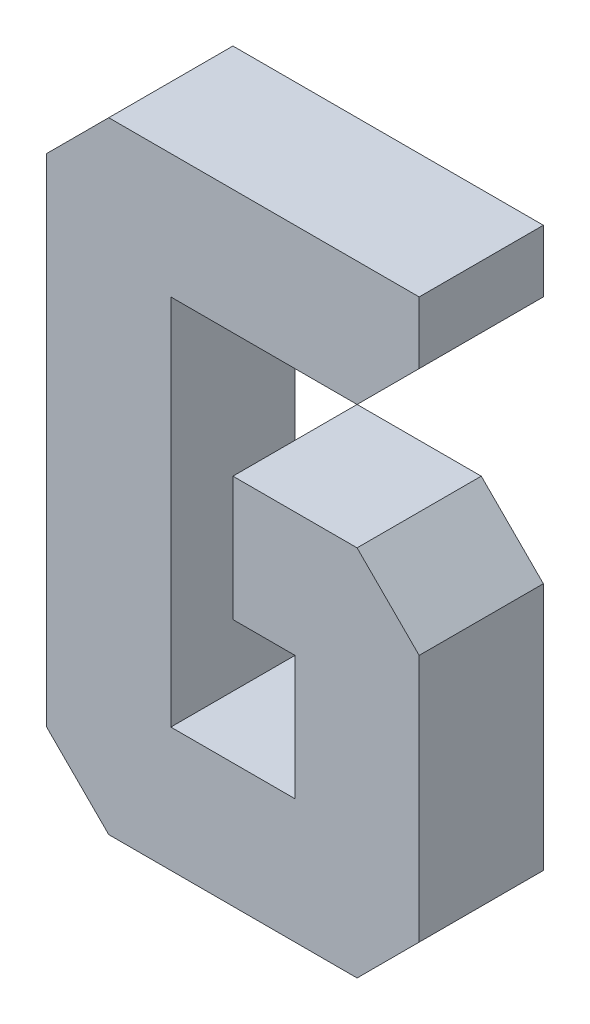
ISO-10303-21;
HEADER;
FILE_DESCRIPTION(('STEP AP214'),'2;1');
FILE_NAME('part.step','',(''),(''),'','','');
FILE_SCHEMA(('AUTOMOTIVE_DESIGN { 1 0 10303 214 1 1 1 1 }'));
ENDSEC;
DATA;
#1=APPLICATION_CONTEXT('core data for automotive mechanical design processes');
#2=APPLICATION_PROTOCOL_DEFINITION('international standard','automotive_design',2000,#1);
#3=PRODUCT_CONTEXT('',#1,'mechanical');
#4=PRODUCT('Part','Part','',(#3));
#5=PRODUCT_RELATED_PRODUCT_CATEGORY('part','',(#4));
#6=PRODUCT_DEFINITION_FORMATION('','',#4);
#7=PRODUCT_DEFINITION_CONTEXT('part definition',#1,'design');
#8=PRODUCT_DEFINITION('design','',#6,#7);
#9=PRODUCT_DEFINITION_SHAPE('','',#8);
#10=(LENGTH_UNIT() NAMED_UNIT(*) SI_UNIT(.MILLI.,.METRE.));
#11=(NAMED_UNIT(*) PLANE_ANGLE_UNIT() SI_UNIT($,.RADIAN.));
#12=(NAMED_UNIT(*) SI_UNIT($,.STERADIAN.) SOLID_ANGLE_UNIT());
#13=UNCERTAINTY_MEASURE_WITH_UNIT(LENGTH_MEASURE(1.E-05),#10,'distance_accuracy_value','');
#14=(GEOMETRIC_REPRESENTATION_CONTEXT(3) GLOBAL_UNCERTAINTY_ASSIGNED_CONTEXT((#13)) GLOBAL_UNIT_ASSIGNED_CONTEXT((#10,
#11,#12)) REPRESENTATION_CONTEXT('',''));
#15=CARTESIAN_POINT('',(0.,0.,0.));
#16=DIRECTION('',(0.,0.,1.));
#17=DIRECTION('',(1.,0.,0.));
#18=AXIS2_PLACEMENT_3D('',#15,#16,#17);
#19=CARTESIAN_POINT('',(0.,30.,10.));
#20=DIRECTION('',(0.,-1.,0.));
#21=DIRECTION('',(1.,0.,0.));
#22=AXIS2_PLACEMENT_3D('',#19,#20,#21);
#23=PLANE('',#22);
#24=DIRECTION('',(-1.,0.,0.));
#25=VECTOR('',#24,1.);
#26=CARTESIAN_POINT('',(0.,30.,10.));
#27=LINE('',#26,#25);
#28=CARTESIAN_POINT('',(25.,30.,10.));
#29=VERTEX_POINT('',#28);
#30=CARTESIAN_POINT('',(15.,30.,10.));
#31=VERTEX_POINT('',#30);
#32=EDGE_CURVE('E151',#29,#31,#27,.T.);
#33=ORIENTED_EDGE('',*,*,#32,.F.);
#34=DIRECTION('',(0.,0.,-1.));
#35=VECTOR('',#34,1.);
#36=CARTESIAN_POINT('',(25.,30.,10.));
#37=LINE('',#36,#35);
#38=CARTESIAN_POINT('',(25.,30.,0.));
#39=VERTEX_POINT('',#38);
#40=EDGE_CURVE('E177',#29,#39,#37,.T.);
#41=ORIENTED_EDGE('',*,*,#40,.T.);
#42=DIRECTION('',(-1.,0.,0.));
#43=VECTOR('',#42,1.);
#44=CARTESIAN_POINT('',(0.,30.,0.));
#45=LINE('',#44,#43);
#46=CARTESIAN_POINT('',(15.,30.,0.));
#47=VERTEX_POINT('',#46);
#48=EDGE_CURVE('E175',#39,#47,#45,.T.);
#49=ORIENTED_EDGE('',*,*,#48,.T.);
#50=DIRECTION('',(0.,0.,-1.));
#51=VECTOR('',#50,1.);
#52=CARTESIAN_POINT('',(15.,30.,10.));
#53=LINE('',#52,#51);
#54=EDGE_CURVE('E169',#31,#47,#53,.T.);
#55=ORIENTED_EDGE('',*,*,#54,.F.);
#56=EDGE_LOOP('',(#33,#41,#49,#55));
#57=FACE_BOUND('',#56,.T.);
#58=ADVANCED_FACE('F35',(#57),#23,.F.);
#59=CARTESIAN_POINT('',(15.,0.,10.));
#60=DIRECTION('',(1.,0.,0.));
#61=DIRECTION('',(0.,1.,0.));
#62=AXIS2_PLACEMENT_3D('',#59,#60,#61);
#63=PLANE('',#62);
#64=DIRECTION('',(0.,-1.,0.));
#65=VECTOR('',#64,1.);
#66=CARTESIAN_POINT('',(15.,0.,0.));
#67=LINE('',#66,#65);
#68=CARTESIAN_POINT('',(15.,20.,0.));
#69=VERTEX_POINT('',#68);
#70=EDGE_CURVE('E266',#47,#69,#67,.T.);
#71=ORIENTED_EDGE('',*,*,#70,.T.);
#72=DIRECTION('',(0.,0.,-1.));
#73=VECTOR('',#72,1.);
#74=CARTESIAN_POINT('',(15.,20.,10.));
#75=LINE('',#74,#73);
#76=CARTESIAN_POINT('',(15.,20.,10.));
#77=VERTEX_POINT('',#76);
#78=EDGE_CURVE('E170',#77,#69,#75,.T.);
#79=ORIENTED_EDGE('',*,*,#78,.F.);
#80=DIRECTION('',(0.,-1.,0.));
#81=VECTOR('',#80,1.);
#82=CARTESIAN_POINT('',(15.,0.,10.));
#83=LINE('',#82,#81);
#84=EDGE_CURVE('E155',#31,#77,#83,.T.);
#85=ORIENTED_EDGE('',*,*,#84,.F.);
#86=ORIENTED_EDGE('',*,*,#54,.T.);
#87=EDGE_LOOP('',(#71,#79,#85,#86));
#88=FACE_BOUND('',#87,.T.);
#89=ADVANCED_FACE('F168',(#88),#63,.F.);
#90=CARTESIAN_POINT('',(0.,20.,10.));
#91=DIRECTION('',(0.,-1.,0.));
#92=DIRECTION('',(0.,0.,-1.));
#93=AXIS2_PLACEMENT_3D('',#90,#91,#92);
#94=PLANE('',#93);
#95=DIRECTION('',(-1.,0.,0.));
#96=VECTOR('',#95,1.);
#97=CARTESIAN_POINT('',(0.,20.,0.));
#98=LINE('',#97,#96);
#99=CARTESIAN_POINT('',(20.,20.,0.));
#100=VERTEX_POINT('',#99);
#101=EDGE_CURVE('E264',#100,#69,#98,.T.);
#102=ORIENTED_EDGE('',*,*,#101,.F.);
#103=DIRECTION('',(0.,0.,-1.));
#104=VECTOR('',#103,1.);
#105=CARTESIAN_POINT('',(20.,20.,10.));
#106=LINE('',#105,#104);
#107=CARTESIAN_POINT('',(20.,20.,10.));
#108=VERTEX_POINT('',#107);
#109=EDGE_CURVE('E181',#108,#100,#106,.T.);
#110=ORIENTED_EDGE('',*,*,#109,.F.);
#111=DIRECTION('',(-1.,0.,0.));
#112=VECTOR('',#111,1.);
#113=CARTESIAN_POINT('',(0.,20.,10.));
#114=LINE('',#113,#112);
#115=EDGE_CURVE('E172',#108,#77,#114,.T.);
#116=ORIENTED_EDGE('',*,*,#115,.T.);
#117=ORIENTED_EDGE('',*,*,#78,.T.);
#118=EDGE_LOOP('',(#102,#110,#116,#117));
#119=FACE_BOUND('',#118,.T.);
#120=ADVANCED_FACE('F265',(#119),#94,.T.);
#121=CARTESIAN_POINT('',(20.,0.,10.));
#122=DIRECTION('',(-1.,0.,0.));
#123=DIRECTION('',(0.,0.,1.));
#124=AXIS2_PLACEMENT_3D('',#121,#122,#123);
#125=PLANE('',#124);
#126=DIRECTION('',(0.,1.,0.));
#127=VECTOR('',#126,1.);
#128=CARTESIAN_POINT('',(20.,0.,0.));
#129=LINE('',#128,#127);
#130=CARTESIAN_POINT('',(20.,10.,0.));
#131=VERTEX_POINT('',#130);
#132=EDGE_CURVE('E258',#131,#100,#129,.T.);
#133=ORIENTED_EDGE('',*,*,#132,.F.);
#134=DIRECTION('',(0.,0.,-1.));
#135=VECTOR('',#134,1.);
#136=CARTESIAN_POINT('',(20.,10.,10.));
#137=LINE('',#136,#135);
#138=CARTESIAN_POINT('',(20.,10.,10.));
#139=VERTEX_POINT('',#138);
#140=EDGE_CURVE('E251',#139,#131,#137,.T.);
#141=ORIENTED_EDGE('',*,*,#140,.F.);
#142=DIRECTION('',(0.,1.,0.));
#143=VECTOR('',#142,1.);
#144=CARTESIAN_POINT('',(20.,0.,10.));
#145=LINE('',#144,#143);
#146=EDGE_CURVE('E261',#139,#108,#145,.T.);
#147=ORIENTED_EDGE('',*,*,#146,.T.);
#148=ORIENTED_EDGE('',*,*,#109,.T.);
#149=EDGE_LOOP('',(#133,#141,#147,#148));
#150=FACE_BOUND('',#149,.T.);
#151=ADVANCED_FACE('F256',(#150),#125,.T.);
#152=CARTESIAN_POINT('',(0.,10.,10.));
#153=DIRECTION('',(0.,1.,0.));
#154=DIRECTION('',(-1.,0.,0.));
#155=AXIS2_PLACEMENT_3D('',#152,#153,#154);
#156=PLANE('',#155);
#157=DIRECTION('',(1.,0.,0.));
#158=VECTOR('',#157,1.);
#159=CARTESIAN_POINT('',(0.,10.,0.));
#160=LINE('',#159,#158);
#161=CARTESIAN_POINT('',(10.,10.,0.));
#162=VERTEX_POINT('',#161);
#163=EDGE_CURVE('E270',#162,#131,#160,.T.);
#164=ORIENTED_EDGE('',*,*,#163,.F.);
#165=DIRECTION('',(0.,0.,-1.));
#166=VECTOR('',#165,1.);
#167=CARTESIAN_POINT('',(10.,10.,10.));
#168=LINE('',#167,#166);
#169=CARTESIAN_POINT('',(10.,10.,10.));
#170=VERTEX_POINT('',#169);
#171=EDGE_CURVE('E249',#170,#162,#168,.T.);
#172=ORIENTED_EDGE('',*,*,#171,.F.);
#173=DIRECTION('',(1.,0.,0.));
#174=VECTOR('',#173,1.);
#175=CARTESIAN_POINT('',(0.,10.,10.));
#176=LINE('',#175,#174);
#177=EDGE_CURVE('E316',#170,#139,#176,.T.);
#178=ORIENTED_EDGE('',*,*,#177,.T.);
#179=ORIENTED_EDGE('',*,*,#140,.T.);
#180=EDGE_LOOP('',(#164,#172,#178,#179));
#181=FACE_BOUND('',#180,.T.);
#182=ADVANCED_FACE('F314',(#181),#156,.T.);
#183=CARTESIAN_POINT('',(10.,0.,10.));
#184=DIRECTION('',(-1.,0.,0.));
#185=DIRECTION('',(0.,-1.,0.));
#186=AXIS2_PLACEMENT_3D('',#183,#184,#185);
#187=PLANE('',#186);
#188=DIRECTION('',(0.,1.,0.));
#189=VECTOR('',#188,1.);
#190=CARTESIAN_POINT('',(10.,0.,0.));
#191=LINE('',#190,#189);
#192=CARTESIAN_POINT('',(10.,40.,0.));
#193=VERTEX_POINT('',#192);
#194=EDGE_CURVE('E272',#162,#193,#191,.T.);
#195=ORIENTED_EDGE('',*,*,#194,.T.);
#196=DIRECTION('',(0.,0.,-1.));
#197=VECTOR('',#196,1.);
#198=CARTESIAN_POINT('',(10.,40.,10.));
#199=LINE('',#198,#197);
#200=CARTESIAN_POINT('',(10.,40.,10.));
#201=VERTEX_POINT('',#200);
#202=EDGE_CURVE('E245',#201,#193,#199,.T.);
#203=ORIENTED_EDGE('',*,*,#202,.F.);
#204=DIRECTION('',(0.,1.,0.));
#205=VECTOR('',#204,1.);
#206=CARTESIAN_POINT('',(10.,0.,10.));
#207=LINE('',#206,#205);
#208=EDGE_CURVE('E311',#170,#201,#207,.T.);
#209=ORIENTED_EDGE('',*,*,#208,.F.);
#210=ORIENTED_EDGE('',*,*,#171,.T.);
#211=EDGE_LOOP('',(#195,#203,#209,#210));
#212=FACE_BOUND('',#211,.T.);
#213=ADVANCED_FACE('F310',(#212),#187,.F.);
#214=CARTESIAN_POINT('',(0.,40.,10.));
#215=DIRECTION('',(0.,1.,0.));
#216=DIRECTION('',(0.,0.,1.));
#217=AXIS2_PLACEMENT_3D('',#214,#215,#216);
#218=PLANE('',#217);
#219=DIRECTION('',(1.,0.,0.));
#220=VECTOR('',#219,1.);
#221=CARTESIAN_POINT('',(0.,40.,0.));
#222=LINE('',#221,#220);
#223=CARTESIAN_POINT('',(25.,40.,0.));
#224=VERTEX_POINT('',#223);
#225=EDGE_CURVE('E277',#193,#224,#222,.T.);
#226=ORIENTED_EDGE('',*,*,#225,.T.);
#227=DIRECTION('',(0.,0.,1.));
#228=VECTOR('',#227,1.);
#229=CARTESIAN_POINT('',(25.,40.,10.));
#230=LINE('',#229,#228);
#231=CARTESIAN_POINT('',(25.,40.,10.));
#232=VERTEX_POINT('',#231);
#233=EDGE_CURVE('E217',#224,#232,#230,.T.);
#234=ORIENTED_EDGE('',*,*,#233,.T.);
#235=DIRECTION('',(1.,0.,0.));
#236=VECTOR('',#235,1.);
#237=CARTESIAN_POINT('',(0.,40.,10.));
#238=LINE('',#237,#236);
#239=EDGE_CURVE('E307',#201,#232,#238,.T.);
#240=ORIENTED_EDGE('',*,*,#239,.F.);
#241=ORIENTED_EDGE('',*,*,#202,.T.);
#242=EDGE_LOOP('',(#226,#234,#240,#241));
#243=FACE_BOUND('',#242,.T.);
#244=ADVANCED_FACE('F303',(#243),#218,.F.);
#245=CARTESIAN_POINT('',(30.,0.,10.));
#246=DIRECTION('',(1.,0.,0.));
#247=DIRECTION('',(0.,1.,0.));
#248=AXIS2_PLACEMENT_3D('',#245,#246,#247);
#249=PLANE('',#248);
#250=DIRECTION('',(0.,-1.,0.));
#251=VECTOR('',#250,1.);
#252=CARTESIAN_POINT('',(30.,0.,10.));
#253=LINE('',#252,#251);
#254=CARTESIAN_POINT('',(30.,50.,10.));
#255=VERTEX_POINT('',#254);
#256=CARTESIAN_POINT('',(30.,45.,10.));
#257=VERTEX_POINT('',#256);
#258=EDGE_CURVE('E296',#255,#257,#253,.T.);
#259=ORIENTED_EDGE('',*,*,#258,.T.);
#260=DIRECTION('',(0.,0.,-1.));
#261=VECTOR('',#260,1.);
#262=CARTESIAN_POINT('',(30.,45.,0.));
#263=LINE('',#262,#261);
#264=CARTESIAN_POINT('',(30.,45.,0.));
#265=VERTEX_POINT('',#264);
#266=EDGE_CURVE('E212',#257,#265,#263,.T.);
#267=ORIENTED_EDGE('',*,*,#266,.T.);
#268=DIRECTION('',(0.,-1.,0.));
#269=VECTOR('',#268,1.);
#270=CARTESIAN_POINT('',(30.,0.,0.));
#271=LINE('',#270,#269);
#272=CARTESIAN_POINT('',(30.,50.,0.));
#273=VERTEX_POINT('',#272);
#274=EDGE_CURVE('E280',#273,#265,#271,.T.);
#275=ORIENTED_EDGE('',*,*,#274,.F.);
#276=DIRECTION('',(0.,0.,-1.));
#277=VECTOR('',#276,1.);
#278=CARTESIAN_POINT('',(30.,50.,10.));
#279=LINE('',#278,#277);
#280=EDGE_CURVE('E242',#255,#273,#279,.T.);
#281=ORIENTED_EDGE('',*,*,#280,.F.);
#282=EDGE_LOOP('',(#259,#267,#275,#281));
#283=FACE_BOUND('',#282,.T.);
#284=ADVANCED_FACE('F294',(#283),#249,.T.);
#285=CARTESIAN_POINT('',(0.,50.,10.));
#286=DIRECTION('',(0.,1.,0.));
#287=DIRECTION('',(0.,0.,1.));
#288=AXIS2_PLACEMENT_3D('',#285,#286,#287);
#289=PLANE('',#288);
#290=DIRECTION('',(1.,0.,0.));
#291=VECTOR('',#290,1.);
#292=CARTESIAN_POINT('',(0.,50.,0.));
#293=LINE('',#292,#291);
#294=CARTESIAN_POINT('',(5.00000000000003,50.,0.));
#295=VERTEX_POINT('',#294);
#296=EDGE_CURVE('E238',#295,#273,#293,.T.);
#297=ORIENTED_EDGE('',*,*,#296,.F.);
#298=DIRECTION('',(0.,0.,1.));
#299=VECTOR('',#298,1.);
#300=CARTESIAN_POINT('',(5.00000000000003,50.,10.));
#301=LINE('',#300,#299);
#302=CARTESIAN_POINT('',(5.00000000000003,50.,10.));
#303=VERTEX_POINT('',#302);
#304=EDGE_CURVE('E207',#295,#303,#301,.T.);
#305=ORIENTED_EDGE('',*,*,#304,.T.);
#306=DIRECTION('',(1.,0.,0.));
#307=VECTOR('',#306,1.);
#308=CARTESIAN_POINT('',(0.,50.,10.));
#309=LINE('',#308,#307);
#310=EDGE_CURVE('E290',#303,#255,#309,.T.);
#311=ORIENTED_EDGE('',*,*,#310,.T.);
#312=ORIENTED_EDGE('',*,*,#280,.T.);
#313=EDGE_LOOP('',(#297,#305,#311,#312));
#314=FACE_BOUND('',#313,.T.);
#315=ADVANCED_FACE('F288',(#314),#289,.T.);
#316=CARTESIAN_POINT('',(0.,0.,10.));
#317=DIRECTION('',(-1.,0.,0.));
#318=DIRECTION('',(0.,-1.,0.));
#319=AXIS2_PLACEMENT_3D('',#316,#317,#318);
#320=PLANE('',#319);
#321=DIRECTION('',(0.,1.,0.));
#322=VECTOR('',#321,1.);
#323=CARTESIAN_POINT('',(0.,0.,0.));
#324=LINE('',#323,#322);
#325=CARTESIAN_POINT('',(0.,5.00000000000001,0.));
#326=VERTEX_POINT('',#325);
#327=CARTESIAN_POINT('',(0.,45.,0.));
#328=VERTEX_POINT('',#327);
#329=EDGE_CURVE('E235',#326,#328,#324,.T.);
#330=ORIENTED_EDGE('',*,*,#329,.F.);
#331=DIRECTION('',(0.,0.,1.));
#332=VECTOR('',#331,1.);
#333=CARTESIAN_POINT('',(0.,5.00000000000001,10.));
#334=LINE('',#333,#332);
#335=CARTESIAN_POINT('',(0.,5.00000000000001,10.));
#336=VERTEX_POINT('',#335);
#337=EDGE_CURVE('E43',#326,#336,#334,.T.);
#338=ORIENTED_EDGE('',*,*,#337,.T.);
#339=DIRECTION('',(0.,1.,0.));
#340=VECTOR('',#339,1.);
#341=CARTESIAN_POINT('',(0.,0.,10.));
#342=LINE('',#341,#340);
#343=CARTESIAN_POINT('',(0.,45.,10.));
#344=VERTEX_POINT('',#343);
#345=EDGE_CURVE('E325',#336,#344,#342,.T.);
#346=ORIENTED_EDGE('',*,*,#345,.T.);
#347=DIRECTION('',(0.,0.,-1.));
#348=VECTOR('',#347,1.);
#349=CARTESIAN_POINT('',(0.,45.,10.));
#350=LINE('',#349,#348);
#351=EDGE_CURVE('E202',#344,#328,#350,.T.);
#352=ORIENTED_EDGE('',*,*,#351,.T.);
#353=EDGE_LOOP('',(#330,#338,#346,#352));
#354=FACE_BOUND('',#353,.T.);
#355=ADVANCED_FACE('F362',(#354),#320,.T.);
#356=CARTESIAN_POINT('',(0.,0.,10.));
#357=DIRECTION('',(0.,1.,0.));
#358=DIRECTION('',(0.,0.,1.));
#359=AXIS2_PLACEMENT_3D('',#356,#357,#358);
#360=PLANE('',#359);
#361=DIRECTION('',(1.,0.,0.));
#362=VECTOR('',#361,1.);
#363=CARTESIAN_POINT('',(0.,0.,10.));
#364=LINE('',#363,#362);
#365=CARTESIAN_POINT('',(4.99999999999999,0.,10.));
#366=VERTEX_POINT('',#365);
#367=CARTESIAN_POINT('',(25.,0.,10.));
#368=VERTEX_POINT('',#367);
#369=EDGE_CURVE('E229',#366,#368,#364,.T.);
#370=ORIENTED_EDGE('',*,*,#369,.F.);
#371=DIRECTION('',(0.,0.,-1.));
#372=VECTOR('',#371,1.);
#373=CARTESIAN_POINT('',(4.99999999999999,0.,0.));
#374=LINE('',#373,#372);
#375=CARTESIAN_POINT('',(4.99999999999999,0.,0.));
#376=VERTEX_POINT('',#375);
#377=EDGE_CURVE('E221',#366,#376,#374,.T.);
#378=ORIENTED_EDGE('',*,*,#377,.T.);
#379=DIRECTION('',(1.,0.,0.));
#380=VECTOR('',#379,1.);
#381=CARTESIAN_POINT('',(0.,0.,0.));
#382=LINE('',#381,#380);
#383=CARTESIAN_POINT('',(25.,0.,0.));
#384=VERTEX_POINT('',#383);
#385=EDGE_CURVE('E228',#376,#384,#382,.T.);
#386=ORIENTED_EDGE('',*,*,#385,.T.);
#387=DIRECTION('',(0.,0.,1.));
#388=VECTOR('',#387,1.);
#389=CARTESIAN_POINT('',(25.,0.,10.));
#390=LINE('',#389,#388);
#391=EDGE_CURVE('E197',#384,#368,#390,.T.);
#392=ORIENTED_EDGE('',*,*,#391,.T.);
#393=EDGE_LOOP('',(#370,#378,#386,#392));
#394=FACE_BOUND('',#393,.T.);
#395=ADVANCED_FACE('F227',(#394),#360,.F.);
#396=CARTESIAN_POINT('',(30.,0.,10.));
#397=DIRECTION('',(-1.,0.,0.));
#398=DIRECTION('',(0.,0.,1.));
#399=AXIS2_PLACEMENT_3D('',#396,#397,#398);
#400=PLANE('',#399);
#401=DIRECTION('',(0.,1.,0.));
#402=VECTOR('',#401,1.);
#403=CARTESIAN_POINT('',(30.,0.,10.));
#404=LINE('',#403,#402);
#405=CARTESIAN_POINT('',(30.,5.,10.));
#406=VERTEX_POINT('',#405);
#407=CARTESIAN_POINT('',(30.,25.,10.));
#408=VERTEX_POINT('',#407);
#409=EDGE_CURVE('E246',#406,#408,#404,.T.);
#410=ORIENTED_EDGE('',*,*,#409,.F.);
#411=DIRECTION('',(0.,0.,-1.));
#412=VECTOR('',#411,1.);
#413=CARTESIAN_POINT('',(30.,5.,10.));
#414=LINE('',#413,#412);
#415=CARTESIAN_POINT('',(30.,5.,0.));
#416=VERTEX_POINT('',#415);
#417=EDGE_CURVE('E191',#406,#416,#414,.T.);
#418=ORIENTED_EDGE('',*,*,#417,.T.);
#419=DIRECTION('',(0.,1.,0.));
#420=VECTOR('',#419,1.);
#421=CARTESIAN_POINT('',(30.,0.,0.));
#422=LINE('',#421,#420);
#423=CARTESIAN_POINT('',(30.,25.,0.));
#424=VERTEX_POINT('',#423);
#425=EDGE_CURVE('E163',#416,#424,#422,.T.);
#426=ORIENTED_EDGE('',*,*,#425,.T.);
#427=DIRECTION('',(0.,0.,1.));
#428=VECTOR('',#427,1.);
#429=CARTESIAN_POINT('',(30.,25.,10.));
#430=LINE('',#429,#428);
#431=EDGE_CURVE('E187',#424,#408,#430,.T.);
#432=ORIENTED_EDGE('',*,*,#431,.T.);
#433=EDGE_LOOP('',(#410,#418,#426,#432));
#434=FACE_BOUND('',#433,.T.);
#435=ADVANCED_FACE('F334',(#434),#400,.F.);
#436=CARTESIAN_POINT('',(0.,0.,10.));
#437=DIRECTION('',(0.,0.,1.));
#438=DIRECTION('',(1.,0.,0.));
#439=AXIS2_PLACEMENT_3D('',#436,#437,#438);
#440=PLANE('',#439);
#441=ORIENTED_EDGE('',*,*,#345,.F.);
#442=DIRECTION('',(0.707106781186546,-0.707106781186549,0.));
#443=VECTOR('',#442,1.);
#444=CARTESIAN_POINT('',(2.50000000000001,2.5,10.));
#445=LINE('',#444,#443);
#446=EDGE_CURVE('E11',#336,#366,#445,.T.);
#447=ORIENTED_EDGE('',*,*,#446,.T.);
#448=ORIENTED_EDGE('',*,*,#369,.T.);
#449=DIRECTION('',(-0.707106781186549,-0.707106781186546,0.));
#450=VECTOR('',#449,1.);
#451=CARTESIAN_POINT('',(12.4999999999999,-12.5,10.));
#452=LINE('',#451,#450);
#453=EDGE_CURVE('E200',#368,#406,#452,.F.);
#454=ORIENTED_EDGE('',*,*,#453,.T.);
#455=ORIENTED_EDGE('',*,*,#409,.T.);
#456=DIRECTION('',(0.707106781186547,-0.707106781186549,0.));
#457=VECTOR('',#456,1.);
#458=CARTESIAN_POINT('',(27.5,27.5,10.));
#459=LINE('',#458,#457);
#460=EDGE_CURVE('E158',#408,#29,#459,.F.);
#461=ORIENTED_EDGE('',*,*,#460,.T.);
#462=ORIENTED_EDGE('',*,*,#32,.T.);
#463=ORIENTED_EDGE('',*,*,#84,.T.);
#464=ORIENTED_EDGE('',*,*,#115,.F.);
#465=ORIENTED_EDGE('',*,*,#146,.F.);
#466=ORIENTED_EDGE('',*,*,#177,.F.);
#467=ORIENTED_EDGE('',*,*,#208,.T.);
#468=ORIENTED_EDGE('',*,*,#239,.T.);
#469=DIRECTION('',(0.70710678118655,0.707106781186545,0.));
#470=VECTOR('',#469,1.);
#471=CARTESIAN_POINT('',(-7.50000000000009,7.50000000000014,10.));
#472=LINE('',#471,#470);
#473=EDGE_CURVE('E219',#232,#257,#472,.T.);
#474=ORIENTED_EDGE('',*,*,#473,.T.);
#475=ORIENTED_EDGE('',*,*,#258,.F.);
#476=ORIENTED_EDGE('',*,*,#310,.F.);
#477=DIRECTION('',(0.707106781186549,0.707106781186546,0.));
#478=VECTOR('',#477,1.);
#479=CARTESIAN_POINT('',(-22.5,22.5000000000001,10.));
#480=LINE('',#479,#478);
#481=EDGE_CURVE('E209',#303,#344,#480,.F.);
#482=ORIENTED_EDGE('',*,*,#481,.T.);
#483=EDGE_LOOP('',(#441,#447,#448,#454,#455,#461,#462,#463,#464,#465,#466,#467,#468,#474,#475,
#476,#482));
#484=FACE_BOUND('',#483,.T.);
#485=ADVANCED_FACE('F153',(#484),#440,.T.);
#486=CARTESIAN_POINT('',(0.,0.,0.));
#487=DIRECTION('',(0.,0.,1.));
#488=DIRECTION('',(1.,0.,0.));
#489=AXIS2_PLACEMENT_3D('',#486,#487,#488);
#490=PLANE('',#489);
#491=ORIENTED_EDGE('',*,*,#385,.F.);
#492=DIRECTION('',(-0.707106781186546,0.707106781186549,0.));
#493=VECTOR('',#492,1.);
#494=CARTESIAN_POINT('',(4.99999999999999,0.,0.));
#495=LINE('',#494,#493);
#496=EDGE_CURVE('E57',#376,#326,#495,.T.);
#497=ORIENTED_EDGE('',*,*,#496,.T.);
#498=ORIENTED_EDGE('',*,*,#329,.T.);
#499=DIRECTION('',(-0.707106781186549,-0.707106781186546,0.));
#500=VECTOR('',#499,1.);
#501=CARTESIAN_POINT('',(0.,45.,0.));
#502=LINE('',#501,#500);
#503=EDGE_CURVE('E205',#328,#295,#502,.F.);
#504=ORIENTED_EDGE('',*,*,#503,.T.);
#505=ORIENTED_EDGE('',*,*,#296,.T.);
#506=ORIENTED_EDGE('',*,*,#274,.T.);
#507=DIRECTION('',(-0.70710678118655,-0.707106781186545,0.));
#508=VECTOR('',#507,1.);
#509=CARTESIAN_POINT('',(30.,45.,0.));
#510=LINE('',#509,#508);
#511=EDGE_CURVE('E215',#265,#224,#510,.T.);
#512=ORIENTED_EDGE('',*,*,#511,.T.);
#513=ORIENTED_EDGE('',*,*,#225,.F.);
#514=ORIENTED_EDGE('',*,*,#194,.F.);
#515=ORIENTED_EDGE('',*,*,#163,.T.);
#516=ORIENTED_EDGE('',*,*,#132,.T.);
#517=ORIENTED_EDGE('',*,*,#101,.T.);
#518=ORIENTED_EDGE('',*,*,#70,.F.);
#519=ORIENTED_EDGE('',*,*,#48,.F.);
#520=DIRECTION('',(-0.707106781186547,0.707106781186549,0.));
#521=VECTOR('',#520,1.);
#522=CARTESIAN_POINT('',(25.,30.,0.));
#523=LINE('',#522,#521);
#524=EDGE_CURVE('E179',#39,#424,#523,.F.);
#525=ORIENTED_EDGE('',*,*,#524,.T.);
#526=ORIENTED_EDGE('',*,*,#425,.F.);
#527=DIRECTION('',(0.707106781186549,0.707106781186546,0.));
#528=VECTOR('',#527,1.);
#529=CARTESIAN_POINT('',(30.,5.,0.));
#530=LINE('',#529,#528);
#531=EDGE_CURVE('E194',#416,#384,#530,.F.);
#532=ORIENTED_EDGE('',*,*,#531,.T.);
#533=EDGE_LOOP('',(#491,#497,#498,#504,#505,#506,#512,#513,#514,#515,#516,#517,#518,#519,#525,
#526,#532));
#534=FACE_BOUND('',#533,.T.);
#535=ADVANCED_FACE('F232',(#534),#490,.F.);
#536=CARTESIAN_POINT('',(25.,30.,10.));
#537=DIRECTION('',(-0.707106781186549,-0.707106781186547,0.));
#538=DIRECTION('',(0.,0.,-1.));
#539=AXIS2_PLACEMENT_3D('',#536,#537,#538);
#540=PLANE('',#539);
#541=ORIENTED_EDGE('',*,*,#460,.F.);
#542=ORIENTED_EDGE('',*,*,#431,.F.);
#543=ORIENTED_EDGE('',*,*,#524,.F.);
#544=ORIENTED_EDGE('',*,*,#40,.F.);
#545=EDGE_LOOP('',(#541,#542,#543,#544));
#546=FACE_BOUND('',#545,.T.);
#547=ADVANCED_FACE('F331',(#546),#540,.F.);
#548=CARTESIAN_POINT('',(30.,5.,10.));
#549=DIRECTION('',(-0.707106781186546,0.707106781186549,0.));
#550=DIRECTION('',(0.,0.,-1.));
#551=AXIS2_PLACEMENT_3D('',#548,#549,#550);
#552=PLANE('',#551);
#553=ORIENTED_EDGE('',*,*,#453,.F.);
#554=ORIENTED_EDGE('',*,*,#391,.F.);
#555=ORIENTED_EDGE('',*,*,#531,.F.);
#556=ORIENTED_EDGE('',*,*,#417,.F.);
#557=EDGE_LOOP('',(#553,#554,#555,#556));
#558=FACE_BOUND('',#557,.T.);
#559=ADVANCED_FACE('F338',(#558),#552,.F.);
#560=CARTESIAN_POINT('',(0.,45.,10.));
#561=DIRECTION('',(0.707106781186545,-0.707106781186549,0.));
#562=DIRECTION('',(0.,0.,-1.));
#563=AXIS2_PLACEMENT_3D('',#560,#561,#562);
#564=PLANE('',#563);
#565=ORIENTED_EDGE('',*,*,#481,.F.);
#566=ORIENTED_EDGE('',*,*,#304,.F.);
#567=ORIENTED_EDGE('',*,*,#503,.F.);
#568=ORIENTED_EDGE('',*,*,#351,.F.);
#569=EDGE_LOOP('',(#565,#566,#567,#568));
#570=FACE_BOUND('',#569,.T.);
#571=ADVANCED_FACE('F343',(#570),#564,.F.);
#572=CARTESIAN_POINT('',(30.,45.,10.));
#573=DIRECTION('',(0.707106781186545,-0.70710678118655,0.));
#574=DIRECTION('',(0.,0.,1.));
#575=AXIS2_PLACEMENT_3D('',#572,#573,#574);
#576=PLANE('',#575);
#577=ORIENTED_EDGE('',*,*,#473,.F.);
#578=ORIENTED_EDGE('',*,*,#233,.F.);
#579=ORIENTED_EDGE('',*,*,#511,.F.);
#580=ORIENTED_EDGE('',*,*,#266,.F.);
#581=EDGE_LOOP('',(#577,#578,#579,#580));
#582=FACE_BOUND('',#581,.T.);
#583=ADVANCED_FACE('F299',(#582),#576,.T.);
#584=CARTESIAN_POINT('',(4.99999999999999,0.,10.));
#585=DIRECTION('',(-0.707106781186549,-0.707106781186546,0.));
#586=DIRECTION('',(0.,0.,1.));
#587=AXIS2_PLACEMENT_3D('',#584,#585,#586);
#588=PLANE('',#587);
#589=ORIENTED_EDGE('',*,*,#446,.F.);
#590=ORIENTED_EDGE('',*,*,#337,.F.);
#591=ORIENTED_EDGE('',*,*,#496,.F.);
#592=ORIENTED_EDGE('',*,*,#377,.F.);
#593=EDGE_LOOP('',(#589,#590,#591,#592));
#594=FACE_BOUND('',#593,.T.);
#595=ADVANCED_FACE('F37',(#594),#588,.T.);
#596=CLOSED_SHELL('',(#58,#89,#120,#151,#182,#213,#244,#284,#315,#355,#395,#435,#485,#535,#547,
#559,#571,#583,#595));
#597=MANIFOLD_SOLID_BREP('B2',#596);
#598=ADVANCED_BREP_SHAPE_REPRESENTATION('',(#18,#597),#14);
#599=SHAPE_DEFINITION_REPRESENTATION(#9,#598);
ENDSEC;
END-ISO-10303-21;
